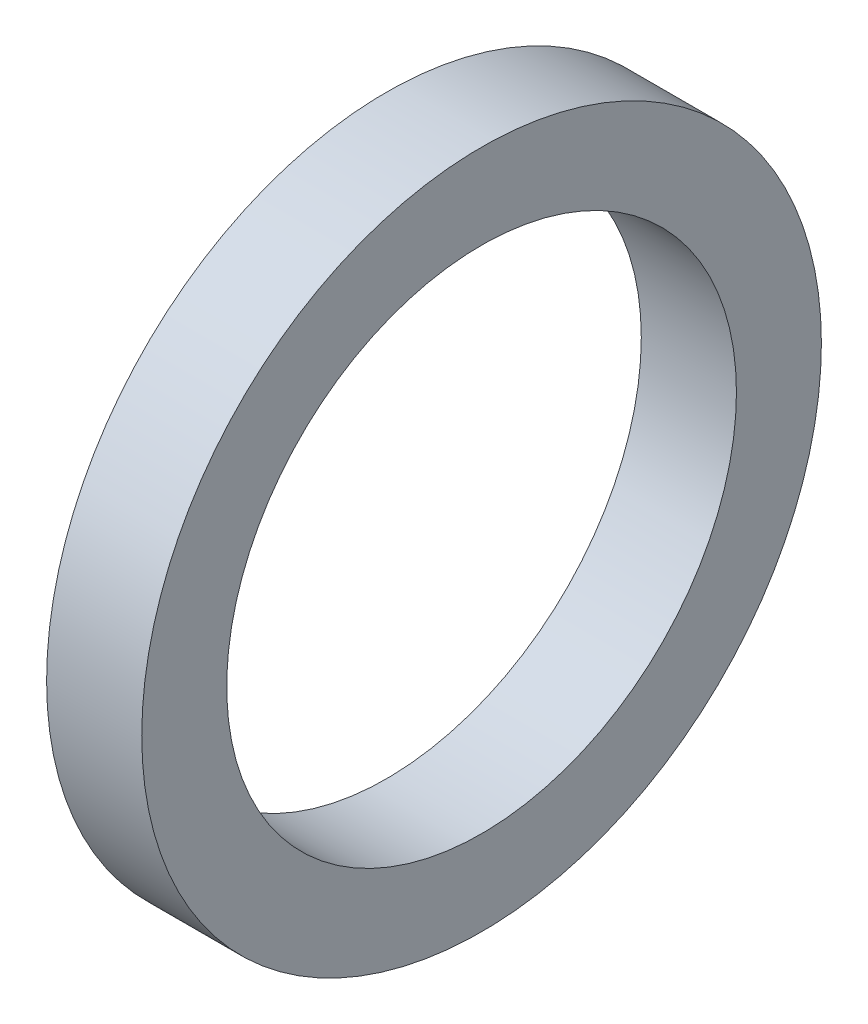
from build123d import *

# Parameters (mm, degrees)
SKETCH1_R           = 10
SKETCH1_R_2         = 7.5
BOSS_EXTRUDE1_DEPTH = 2.8


with BuildPart() as part:
    # Sketch1 → Boss-Extrude1 (new body)
    with BuildSketch(Plane(origin=(0, 0, 0), x_dir=(0, 0, -1), z_dir=(1, 0, 0))):
        Circle(SKETCH1_R)
        Circle(SKETCH1_R_2, mode=Mode.SUBTRACT)
    extrude(amount=BOSS_EXTRUDE1_DEPTH)


solid = part.part
